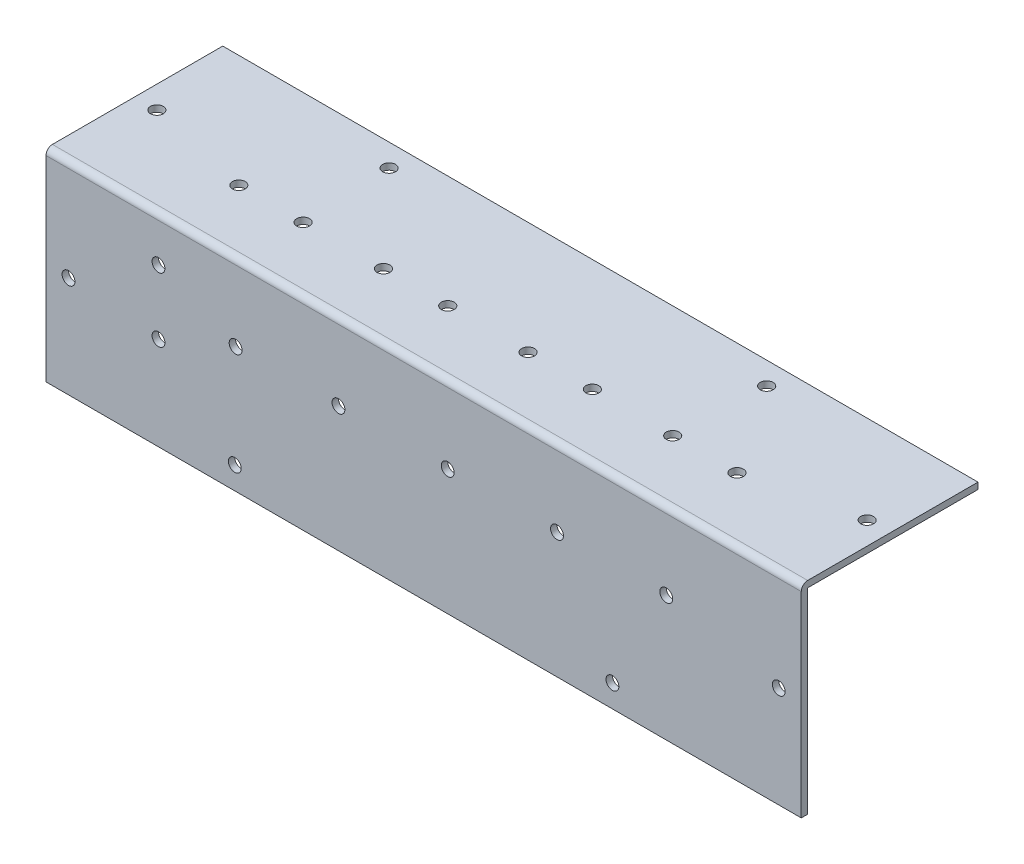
ISO-10303-21;
HEADER;
FILE_DESCRIPTION(('STEP AP214'),'2;1');
FILE_NAME('part.step','',(''),(''),'','','');
FILE_SCHEMA(('AUTOMOTIVE_DESIGN { 1 0 10303 214 1 1 1 1 }'));
ENDSEC;
DATA;
#1=APPLICATION_CONTEXT('core data for automotive mechanical design processes');
#2=APPLICATION_PROTOCOL_DEFINITION('international standard','automotive_design',2000,#1);
#3=PRODUCT_CONTEXT('',#1,'mechanical');
#4=PRODUCT('Part','Part','',(#3));
#5=PRODUCT_RELATED_PRODUCT_CATEGORY('part','',(#4));
#6=PRODUCT_DEFINITION_FORMATION('','',#4);
#7=PRODUCT_DEFINITION_CONTEXT('part definition',#1,'design');
#8=PRODUCT_DEFINITION('design','',#6,#7);
#9=PRODUCT_DEFINITION_SHAPE('','',#8);
#10=(LENGTH_UNIT() NAMED_UNIT(*) SI_UNIT(.MILLI.,.METRE.));
#11=(NAMED_UNIT(*) PLANE_ANGLE_UNIT() SI_UNIT($,.RADIAN.));
#12=(NAMED_UNIT(*) SI_UNIT($,.STERADIAN.) SOLID_ANGLE_UNIT());
#13=UNCERTAINTY_MEASURE_WITH_UNIT(LENGTH_MEASURE(1.E-05),#10,'distance_accuracy_value','');
#14=(GEOMETRIC_REPRESENTATION_CONTEXT(3) GLOBAL_UNCERTAINTY_ASSIGNED_CONTEXT((#13)) GLOBAL_UNIT_ASSIGNED_CONTEXT((#10,
#11,#12)) REPRESENTATION_CONTEXT('',''));
#15=CARTESIAN_POINT('',(0.,0.,0.));
#16=DIRECTION('',(0.,0.,1.));
#17=DIRECTION('',(1.,0.,0.));
#18=AXIS2_PLACEMENT_3D('',#15,#16,#17);
#19=CARTESIAN_POINT('',(0.,0.,2.));
#20=DIRECTION('',(1.,0.,0.));
#21=DIRECTION('',(0.,0.,-1.));
#22=AXIS2_PLACEMENT_3D('',#19,#20,#21);
#23=PLANE('',#22);
#24=DIRECTION('',(0.,-1.,0.));
#25=VECTOR('',#24,1.);
#26=CARTESIAN_POINT('',(0.,0.,2.));
#27=LINE('',#26,#25);
#28=CARTESIAN_POINT('',(0.,61.,2.));
#29=VERTEX_POINT('',#28);
#30=CARTESIAN_POINT('',(0.,0.,2.));
#31=VERTEX_POINT('',#30);
#32=EDGE_CURVE('E132',#29,#31,#27,.T.);
#33=ORIENTED_EDGE('',*,*,#32,.F.);
#34=CARTESIAN_POINT('',(0.,61.,0.));
#35=DIRECTION('',(1.,0.,0.));
#36=DIRECTION('',(0.,0.,-1.));
#37=AXIS2_PLACEMENT_3D('',#34,#35,#36);
#38=CIRCLE('',#37,2.);
#39=CARTESIAN_POINT('',(0.,63.,0.));
#40=VERTEX_POINT('',#39);
#41=EDGE_CURVE('E55',#29,#40,#38,.F.);
#42=ORIENTED_EDGE('',*,*,#41,.T.);
#43=DIRECTION('',(0.,0.,1.));
#44=VECTOR('',#43,1.);
#45=CARTESIAN_POINT('',(0.,63.,-53.));
#46=LINE('',#45,#44);
#47=CARTESIAN_POINT('',(0.,63.,-53.));
#48=VERTEX_POINT('',#47);
#49=EDGE_CURVE('E113',#48,#40,#46,.T.);
#50=ORIENTED_EDGE('',*,*,#49,.F.);
#51=DIRECTION('',(0.,-1.,0.));
#52=VECTOR('',#51,1.);
#53=CARTESIAN_POINT('',(0.,61.,-53.));
#54=LINE('',#53,#52);
#55=CARTESIAN_POINT('',(0.,61.,-53.));
#56=VERTEX_POINT('',#55);
#57=EDGE_CURVE('E108',#48,#56,#54,.T.);
#58=ORIENTED_EDGE('',*,*,#57,.T.);
#59=DIRECTION('',(0.,0.,1.));
#60=VECTOR('',#59,1.);
#61=CARTESIAN_POINT('',(0.,61.,-53.));
#62=LINE('',#61,#60);
#63=CARTESIAN_POINT('',(0.,61.,0.));
#64=VERTEX_POINT('',#63);
#65=EDGE_CURVE('E91',#56,#64,#62,.T.);
#66=ORIENTED_EDGE('',*,*,#65,.T.);
#67=DIRECTION('',(0.,-1.,0.));
#68=VECTOR('',#67,1.);
#69=CARTESIAN_POINT('',(0.,0.,0.));
#70=LINE('',#69,#68);
#71=CARTESIAN_POINT('',(0.,0.,0.));
#72=VERTEX_POINT('',#71);
#73=EDGE_CURVE('E124',#64,#72,#70,.T.);
#74=ORIENTED_EDGE('',*,*,#73,.T.);
#75=DIRECTION('',(0.,0.,-1.));
#76=VECTOR('',#75,1.);
#77=CARTESIAN_POINT('',(0.,0.,2.));
#78=LINE('',#77,#76);
#79=EDGE_CURVE('E206',#31,#72,#78,.T.);
#80=ORIENTED_EDGE('',*,*,#79,.F.);
#81=EDGE_LOOP('',(#33,#42,#50,#58,#66,#74,#80));
#82=FACE_BOUND('',#81,.T.);
#83=ADVANCED_FACE('F33',(#82),#23,.F.);
#84=CARTESIAN_POINT('',(0.,0.,2.));
#85=DIRECTION('',(0.,1.,0.));
#86=DIRECTION('',(0.,0.,1.));
#87=AXIS2_PLACEMENT_3D('',#84,#85,#86);
#88=PLANE('',#87);
#89=DIRECTION('',(1.,0.,0.));
#90=VECTOR('',#89,1.);
#91=CARTESIAN_POINT('',(0.,0.,0.));
#92=LINE('',#91,#90);
#93=CARTESIAN_POINT('',(235.,0.,0.));
#94=VERTEX_POINT('',#93);
#95=EDGE_CURVE('E140',#72,#94,#92,.T.);
#96=ORIENTED_EDGE('',*,*,#95,.T.);
#97=DIRECTION('',(0.,0.,-1.));
#98=VECTOR('',#97,1.);
#99=CARTESIAN_POINT('',(235.,0.,2.));
#100=LINE('',#99,#98);
#101=CARTESIAN_POINT('',(235.,0.,2.));
#102=VERTEX_POINT('',#101);
#103=EDGE_CURVE('E139',#102,#94,#100,.T.);
#104=ORIENTED_EDGE('',*,*,#103,.F.);
#105=DIRECTION('',(1.,0.,0.));
#106=VECTOR('',#105,1.);
#107=CARTESIAN_POINT('',(0.,0.,2.));
#108=LINE('',#107,#106);
#109=EDGE_CURVE('E134',#31,#102,#108,.T.);
#110=ORIENTED_EDGE('',*,*,#109,.F.);
#111=ORIENTED_EDGE('',*,*,#79,.T.);
#112=EDGE_LOOP('',(#96,#104,#110,#111));
#113=FACE_BOUND('',#112,.T.);
#114=ADVANCED_FACE('F218',(#113),#88,.F.);
#115=CARTESIAN_POINT('',(235.,0.,2.));
#116=DIRECTION('',(-1.,0.,0.));
#117=DIRECTION('',(0.,0.,1.));
#118=AXIS2_PLACEMENT_3D('',#115,#116,#117);
#119=PLANE('',#118);
#120=DIRECTION('',(0.,0.,1.));
#121=VECTOR('',#120,1.);
#122=CARTESIAN_POINT('',(235.,63.,-53.));
#123=LINE('',#122,#121);
#124=CARTESIAN_POINT('',(235.,63.,-53.));
#125=VERTEX_POINT('',#124);
#126=CARTESIAN_POINT('',(235.,63.,0.));
#127=VERTEX_POINT('',#126);
#128=EDGE_CURVE('E125',#125,#127,#123,.T.);
#129=ORIENTED_EDGE('',*,*,#128,.T.);
#130=CARTESIAN_POINT('',(235.,61.,0.));
#131=DIRECTION('',(-1.,0.,0.));
#132=DIRECTION('',(0.,0.,1.));
#133=AXIS2_PLACEMENT_3D('',#130,#131,#132);
#134=CIRCLE('',#133,2.);
#135=CARTESIAN_POINT('',(235.,61.,2.));
#136=VERTEX_POINT('',#135);
#137=EDGE_CURVE('E11',#127,#136,#134,.F.);
#138=ORIENTED_EDGE('',*,*,#137,.T.);
#139=DIRECTION('',(0.,1.,0.));
#140=VECTOR('',#139,1.);
#141=CARTESIAN_POINT('',(235.,0.,2.));
#142=LINE('',#141,#140);
#143=EDGE_CURVE('E136',#102,#136,#142,.T.);
#144=ORIENTED_EDGE('',*,*,#143,.F.);
#145=ORIENTED_EDGE('',*,*,#103,.T.);
#146=DIRECTION('',(0.,1.,0.));
#147=VECTOR('',#146,1.);
#148=CARTESIAN_POINT('',(235.,0.,0.));
#149=LINE('',#148,#147);
#150=CARTESIAN_POINT('',(235.,61.,0.));
#151=VERTEX_POINT('',#150);
#152=EDGE_CURVE('E142',#94,#151,#149,.T.);
#153=ORIENTED_EDGE('',*,*,#152,.T.);
#154=DIRECTION('',(0.,0.,1.));
#155=VECTOR('',#154,1.);
#156=CARTESIAN_POINT('',(235.,61.,-53.));
#157=LINE('',#156,#155);
#158=CARTESIAN_POINT('',(235.,61.,-53.));
#159=VERTEX_POINT('',#158);
#160=EDGE_CURVE('E100',#159,#151,#157,.T.);
#161=ORIENTED_EDGE('',*,*,#160,.F.);
#162=DIRECTION('',(0.,1.,0.));
#163=VECTOR('',#162,1.);
#164=CARTESIAN_POINT('',(235.,61.,-53.));
#165=LINE('',#164,#163);
#166=EDGE_CURVE('E111',#159,#125,#165,.T.);
#167=ORIENTED_EDGE('',*,*,#166,.T.);
#168=EDGE_LOOP('',(#129,#138,#144,#145,#153,#161,#167));
#169=FACE_BOUND('',#168,.T.);
#170=ADVANCED_FACE('F221',(#169),#119,.F.);
#171=CARTESIAN_POINT('',(0.,0.,2.));
#172=DIRECTION('',(0.,0.,-1.));
#173=DIRECTION('',(-1.,0.,0.));
#174=AXIS2_PLACEMENT_3D('',#171,#172,#173);
#175=PLANE('',#174);
#176=CARTESIAN_POINT('',(35.,29.,2.));
#177=DIRECTION('',(0.,0.,1.));
#178=DIRECTION('',(1.,0.,0.));
#179=AXIS2_PLACEMENT_3D('',#176,#177,#178);
#180=CIRCLE('',#179,2.);
#181=CARTESIAN_POINT('',(37.,29.,2.));
#182=VERTEX_POINT('',#181);
#183=EDGE_CURVE('E372',#182,#182,#180,.T.);
#184=ORIENTED_EDGE('',*,*,#183,.F.);
#185=EDGE_LOOP('',(#184));
#186=FACE_BOUND('',#185,.T.);
#187=CARTESIAN_POINT('',(35.,49.,2.));
#188=DIRECTION('',(0.,0.,1.));
#189=DIRECTION('',(1.,0.,0.));
#190=AXIS2_PLACEMENT_3D('',#187,#188,#189);
#191=CIRCLE('',#190,2.);
#192=CARTESIAN_POINT('',(37.,49.,2.));
#193=VERTEX_POINT('',#192);
#194=EDGE_CURVE('E378',#193,#193,#191,.T.);
#195=ORIENTED_EDGE('',*,*,#194,.F.);
#196=EDGE_LOOP('',(#195));
#197=FACE_BOUND('',#196,.T.);
#198=CARTESIAN_POINT('',(193.,39.,2.));
#199=DIRECTION('',(0.,0.,1.));
#200=DIRECTION('',(1.,0.,0.));
#201=AXIS2_PLACEMENT_3D('',#198,#199,#200);
#202=CIRCLE('',#201,2.);
#203=CARTESIAN_POINT('',(195.,39.,2.));
#204=VERTEX_POINT('',#203);
#205=EDGE_CURVE('E384',#204,#204,#202,.T.);
#206=ORIENTED_EDGE('',*,*,#205,.F.);
#207=EDGE_LOOP('',(#206));
#208=FACE_BOUND('',#207,.T.);
#209=CARTESIAN_POINT('',(159.,39.,2.));
#210=DIRECTION('',(0.,0.,1.));
#211=DIRECTION('',(1.,0.,0.));
#212=AXIS2_PLACEMENT_3D('',#209,#210,#211);
#213=CIRCLE('',#212,2.);
#214=CARTESIAN_POINT('',(161.,39.,2.));
#215=VERTEX_POINT('',#214);
#216=EDGE_CURVE('E390',#215,#215,#213,.T.);
#217=ORIENTED_EDGE('',*,*,#216,.F.);
#218=EDGE_LOOP('',(#217));
#219=FACE_BOUND('',#218,.T.);
#220=CARTESIAN_POINT('',(125.,39.,2.));
#221=DIRECTION('',(0.,0.,1.));
#222=DIRECTION('',(1.,0.,0.));
#223=AXIS2_PLACEMENT_3D('',#220,#221,#222);
#224=CIRCLE('',#223,2.);
#225=CARTESIAN_POINT('',(127.,39.,2.));
#226=VERTEX_POINT('',#225);
#227=EDGE_CURVE('E396',#226,#226,#224,.T.);
#228=ORIENTED_EDGE('',*,*,#227,.F.);
#229=EDGE_LOOP('',(#228));
#230=FACE_BOUND('',#229,.T.);
#231=CARTESIAN_POINT('',(91.,39.,2.));
#232=DIRECTION('',(0.,0.,1.));
#233=DIRECTION('',(1.,0.,0.));
#234=AXIS2_PLACEMENT_3D('',#231,#232,#233);
#235=CIRCLE('',#234,2.);
#236=CARTESIAN_POINT('',(93.,39.,2.));
#237=VERTEX_POINT('',#236);
#238=EDGE_CURVE('E402',#237,#237,#235,.T.);
#239=ORIENTED_EDGE('',*,*,#238,.F.);
#240=EDGE_LOOP('',(#239));
#241=FACE_BOUND('',#240,.T.);
#242=CARTESIAN_POINT('',(59.,39.,2.));
#243=DIRECTION('',(0.,0.,1.));
#244=DIRECTION('',(1.,0.,0.));
#245=AXIS2_PLACEMENT_3D('',#242,#243,#244);
#246=CIRCLE('',#245,2.);
#247=CARTESIAN_POINT('',(61.,39.,2.));
#248=VERTEX_POINT('',#247);
#249=EDGE_CURVE('E408',#248,#248,#246,.T.);
#250=ORIENTED_EDGE('',*,*,#249,.F.);
#251=EDGE_LOOP('',(#250));
#252=FACE_BOUND('',#251,.T.);
#253=CARTESIAN_POINT('',(58.75,6.99999999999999,2.));
#254=DIRECTION('',(0.,0.,1.));
#255=DIRECTION('',(1.,0.,0.));
#256=AXIS2_PLACEMENT_3D('',#253,#254,#255);
#257=CIRCLE('',#256,2.);
#258=CARTESIAN_POINT('',(60.75,6.99999999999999,2.));
#259=VERTEX_POINT('',#258);
#260=EDGE_CURVE('E414',#259,#259,#257,.T.);
#261=ORIENTED_EDGE('',*,*,#260,.F.);
#262=EDGE_LOOP('',(#261));
#263=FACE_BOUND('',#262,.T.);
#264=CARTESIAN_POINT('',(176.25,7.,2.));
#265=DIRECTION('',(0.,0.,1.));
#266=DIRECTION('',(1.,0.,0.));
#267=AXIS2_PLACEMENT_3D('',#264,#265,#266);
#268=CIRCLE('',#267,2.);
#269=CARTESIAN_POINT('',(178.25,7.,2.));
#270=VERTEX_POINT('',#269);
#271=EDGE_CURVE('E420',#270,#270,#268,.T.);
#272=ORIENTED_EDGE('',*,*,#271,.F.);
#273=EDGE_LOOP('',(#272));
#274=FACE_BOUND('',#273,.T.);
#275=CARTESIAN_POINT('',(228.,31.5,2.));
#276=DIRECTION('',(0.,0.,1.));
#277=DIRECTION('',(1.,0.,0.));
#278=AXIS2_PLACEMENT_3D('',#275,#276,#277);
#279=CIRCLE('',#278,2.);
#280=CARTESIAN_POINT('',(230.,31.5,2.));
#281=VERTEX_POINT('',#280);
#282=EDGE_CURVE('E426',#281,#281,#279,.T.);
#283=ORIENTED_EDGE('',*,*,#282,.F.);
#284=EDGE_LOOP('',(#283));
#285=FACE_BOUND('',#284,.T.);
#286=CARTESIAN_POINT('',(7.,31.5,2.));
#287=DIRECTION('',(0.,0.,1.));
#288=DIRECTION('',(1.,0.,0.));
#289=AXIS2_PLACEMENT_3D('',#286,#287,#288);
#290=CIRCLE('',#289,2.);
#291=CARTESIAN_POINT('',(9.00000000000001,31.5,2.));
#292=VERTEX_POINT('',#291);
#293=EDGE_CURVE('E114',#292,#292,#290,.T.);
#294=ORIENTED_EDGE('',*,*,#293,.F.);
#295=EDGE_LOOP('',(#294));
#296=FACE_BOUND('',#295,.T.);
#297=ORIENTED_EDGE('',*,*,#143,.T.);
#298=DIRECTION('',(-1.,0.,0.));
#299=VECTOR('',#298,1.);
#300=CARTESIAN_POINT('',(0.,61.,2.));
#301=LINE('',#300,#299);
#302=EDGE_CURVE('E203',#136,#29,#301,.T.);
#303=ORIENTED_EDGE('',*,*,#302,.T.);
#304=ORIENTED_EDGE('',*,*,#32,.T.);
#305=ORIENTED_EDGE('',*,*,#109,.T.);
#306=EDGE_LOOP('',(#297,#303,#304,#305));
#307=FACE_BOUND('',#306,.T.);
#308=ADVANCED_FACE('F223',(#186,#197,#208,#219,#230,#241,#252,#263,#274,#285,#296,#307),#175,.F.);
#309=CARTESIAN_POINT('',(0.,0.,0.));
#310=DIRECTION('',(0.,0.,-1.));
#311=DIRECTION('',(-1.,0.,0.));
#312=AXIS2_PLACEMENT_3D('',#309,#310,#311);
#313=PLANE('',#312);
#314=CARTESIAN_POINT('',(35.,29.,0.));
#315=DIRECTION('',(0.,0.,-1.));
#316=DIRECTION('',(-1.,0.,0.));
#317=AXIS2_PLACEMENT_3D('',#314,#315,#316);
#318=CIRCLE('',#317,2.);
#319=CARTESIAN_POINT('',(33.,29.,0.));
#320=VERTEX_POINT('',#319);
#321=EDGE_CURVE('E157',#320,#320,#318,.F.);
#322=ORIENTED_EDGE('',*,*,#321,.T.);
#323=EDGE_LOOP('',(#322));
#324=FACE_BOUND('',#323,.T.);
#325=CARTESIAN_POINT('',(35.,49.,0.));
#326=DIRECTION('',(0.,0.,-1.));
#327=DIRECTION('',(-1.,0.,0.));
#328=AXIS2_PLACEMENT_3D('',#325,#326,#327);
#329=CIRCLE('',#328,2.);
#330=CARTESIAN_POINT('',(33.,49.,0.));
#331=VERTEX_POINT('',#330);
#332=EDGE_CURVE('E375',#331,#331,#329,.F.);
#333=ORIENTED_EDGE('',*,*,#332,.T.);
#334=EDGE_LOOP('',(#333));
#335=FACE_BOUND('',#334,.T.);
#336=CARTESIAN_POINT('',(193.,39.,0.));
#337=DIRECTION('',(0.,0.,-1.));
#338=DIRECTION('',(-1.,0.,0.));
#339=AXIS2_PLACEMENT_3D('',#336,#337,#338);
#340=CIRCLE('',#339,2.);
#341=CARTESIAN_POINT('',(191.,39.,0.));
#342=VERTEX_POINT('',#341);
#343=EDGE_CURVE('E381',#342,#342,#340,.F.);
#344=ORIENTED_EDGE('',*,*,#343,.T.);
#345=EDGE_LOOP('',(#344));
#346=FACE_BOUND('',#345,.T.);
#347=CARTESIAN_POINT('',(159.,39.,0.));
#348=DIRECTION('',(0.,0.,-1.));
#349=DIRECTION('',(-1.,0.,0.));
#350=AXIS2_PLACEMENT_3D('',#347,#348,#349);
#351=CIRCLE('',#350,2.);
#352=CARTESIAN_POINT('',(157.,39.,0.));
#353=VERTEX_POINT('',#352);
#354=EDGE_CURVE('E387',#353,#353,#351,.F.);
#355=ORIENTED_EDGE('',*,*,#354,.T.);
#356=EDGE_LOOP('',(#355));
#357=FACE_BOUND('',#356,.T.);
#358=CARTESIAN_POINT('',(125.,39.,0.));
#359=DIRECTION('',(0.,0.,-1.));
#360=DIRECTION('',(-1.,0.,0.));
#361=AXIS2_PLACEMENT_3D('',#358,#359,#360);
#362=CIRCLE('',#361,2.);
#363=CARTESIAN_POINT('',(123.,39.,0.));
#364=VERTEX_POINT('',#363);
#365=EDGE_CURVE('E393',#364,#364,#362,.F.);
#366=ORIENTED_EDGE('',*,*,#365,.T.);
#367=EDGE_LOOP('',(#366));
#368=FACE_BOUND('',#367,.T.);
#369=CARTESIAN_POINT('',(91.,39.,0.));
#370=DIRECTION('',(0.,0.,-1.));
#371=DIRECTION('',(-1.,0.,0.));
#372=AXIS2_PLACEMENT_3D('',#369,#370,#371);
#373=CIRCLE('',#372,2.);
#374=CARTESIAN_POINT('',(89.,39.,0.));
#375=VERTEX_POINT('',#374);
#376=EDGE_CURVE('E399',#375,#375,#373,.F.);
#377=ORIENTED_EDGE('',*,*,#376,.T.);
#378=EDGE_LOOP('',(#377));
#379=FACE_BOUND('',#378,.T.);
#380=CARTESIAN_POINT('',(59.,39.,0.));
#381=DIRECTION('',(0.,0.,-1.));
#382=DIRECTION('',(-1.,0.,0.));
#383=AXIS2_PLACEMENT_3D('',#380,#381,#382);
#384=CIRCLE('',#383,2.);
#385=CARTESIAN_POINT('',(57.,39.,0.));
#386=VERTEX_POINT('',#385);
#387=EDGE_CURVE('E405',#386,#386,#384,.F.);
#388=ORIENTED_EDGE('',*,*,#387,.T.);
#389=EDGE_LOOP('',(#388));
#390=FACE_BOUND('',#389,.T.);
#391=CARTESIAN_POINT('',(58.75,6.99999999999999,0.));
#392=DIRECTION('',(0.,0.,-1.));
#393=DIRECTION('',(-1.,0.,0.));
#394=AXIS2_PLACEMENT_3D('',#391,#392,#393);
#395=CIRCLE('',#394,2.);
#396=CARTESIAN_POINT('',(56.75,6.99999999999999,0.));
#397=VERTEX_POINT('',#396);
#398=EDGE_CURVE('E411',#397,#397,#395,.F.);
#399=ORIENTED_EDGE('',*,*,#398,.T.);
#400=EDGE_LOOP('',(#399));
#401=FACE_BOUND('',#400,.T.);
#402=CARTESIAN_POINT('',(176.25,7.,0.));
#403=DIRECTION('',(0.,0.,-1.));
#404=DIRECTION('',(-1.,0.,0.));
#405=AXIS2_PLACEMENT_3D('',#402,#403,#404);
#406=CIRCLE('',#405,2.);
#407=CARTESIAN_POINT('',(174.25,7.,0.));
#408=VERTEX_POINT('',#407);
#409=EDGE_CURVE('E417',#408,#408,#406,.F.);
#410=ORIENTED_EDGE('',*,*,#409,.T.);
#411=EDGE_LOOP('',(#410));
#412=FACE_BOUND('',#411,.T.);
#413=CARTESIAN_POINT('',(228.,31.5,0.));
#414=DIRECTION('',(0.,0.,-1.));
#415=DIRECTION('',(-1.,0.,0.));
#416=AXIS2_PLACEMENT_3D('',#413,#414,#415);
#417=CIRCLE('',#416,2.);
#418=CARTESIAN_POINT('',(226.,31.5,0.));
#419=VERTEX_POINT('',#418);
#420=EDGE_CURVE('E423',#419,#419,#417,.F.);
#421=ORIENTED_EDGE('',*,*,#420,.T.);
#422=EDGE_LOOP('',(#421));
#423=FACE_BOUND('',#422,.T.);
#424=CARTESIAN_POINT('',(7.,31.5,0.));
#425=DIRECTION('',(0.,0.,-1.));
#426=DIRECTION('',(-1.,0.,0.));
#427=AXIS2_PLACEMENT_3D('',#424,#425,#426);
#428=CIRCLE('',#427,2.);
#429=CARTESIAN_POINT('',(5.,31.5,0.));
#430=VERTEX_POINT('',#429);
#431=EDGE_CURVE('E117',#430,#430,#428,.F.);
#432=ORIENTED_EDGE('',*,*,#431,.T.);
#433=EDGE_LOOP('',(#432));
#434=FACE_BOUND('',#433,.T.);
#435=ORIENTED_EDGE('',*,*,#73,.F.);
#436=DIRECTION('',(-1.,0.,0.));
#437=VECTOR('',#436,1.);
#438=CARTESIAN_POINT('',(0.,61.,0.));
#439=LINE('',#438,#437);
#440=EDGE_CURVE('E97',#151,#64,#439,.T.);
#441=ORIENTED_EDGE('',*,*,#440,.F.);
#442=ORIENTED_EDGE('',*,*,#152,.F.);
#443=ORIENTED_EDGE('',*,*,#95,.F.);
#444=EDGE_LOOP('',(#435,#441,#442,#443));
#445=FACE_BOUND('',#444,.T.);
#446=ADVANCED_FACE('F215',(#324,#335,#346,#357,#368,#379,#390,#401,#412,#423,#434,#445),#313,.T.);
#447=CARTESIAN_POINT('',(0.,63.,-53.));
#448=DIRECTION('',(0.,1.,0.));
#449=DIRECTION('',(0.,0.,1.));
#450=AXIS2_PLACEMENT_3D('',#447,#448,#449);
#451=PLANE('',#450);
#452=CARTESIAN_POINT('',(7.,63.,-25.5));
#453=DIRECTION('',(0.,1.,0.));
#454=DIRECTION('',(0.,0.,1.));
#455=AXIS2_PLACEMENT_3D('',#452,#453,#454);
#456=CIRCLE('',#455,2.);
#457=CARTESIAN_POINT('',(7.,63.,-23.5));
#458=VERTEX_POINT('',#457);
#459=EDGE_CURVE('E202',#458,#458,#456,.T.);
#460=ORIENTED_EDGE('',*,*,#459,.F.);
#461=EDGE_LOOP('',(#460));
#462=FACE_BOUND('',#461,.T.);
#463=CARTESIAN_POINT('',(58.75,63.,-46.));
#464=DIRECTION('',(0.,1.,0.));
#465=DIRECTION('',(0.,0.,1.));
#466=AXIS2_PLACEMENT_3D('',#463,#464,#465);
#467=CIRCLE('',#466,2.);
#468=CARTESIAN_POINT('',(58.75,63.,-44.));
#469=VERTEX_POINT('',#468);
#470=EDGE_CURVE('E198',#469,#469,#467,.T.);
#471=ORIENTED_EDGE('',*,*,#470,.F.);
#472=EDGE_LOOP('',(#471));
#473=FACE_BOUND('',#472,.T.);
#474=CARTESIAN_POINT('',(176.25,63.,-46.));
#475=DIRECTION('',(0.,1.,0.));
#476=DIRECTION('',(0.,0.,1.));
#477=AXIS2_PLACEMENT_3D('',#474,#475,#476);
#478=CIRCLE('',#477,2.);
#479=CARTESIAN_POINT('',(176.25,63.,-44.));
#480=VERTEX_POINT('',#479);
#481=EDGE_CURVE('E194',#480,#480,#478,.T.);
#482=ORIENTED_EDGE('',*,*,#481,.F.);
#483=EDGE_LOOP('',(#482));
#484=FACE_BOUND('',#483,.T.);
#485=CARTESIAN_POINT('',(228.,63.,-25.5));
#486=DIRECTION('',(0.,1.,0.));
#487=DIRECTION('',(0.,0.,1.));
#488=AXIS2_PLACEMENT_3D('',#485,#486,#487);
#489=CIRCLE('',#488,2.);
#490=CARTESIAN_POINT('',(228.,63.,-23.5));
#491=VERTEX_POINT('',#490);
#492=EDGE_CURVE('E190',#491,#491,#489,.T.);
#493=ORIENTED_EDGE('',*,*,#492,.F.);
#494=EDGE_LOOP('',(#493));
#495=FACE_BOUND('',#494,.T.);
#496=CARTESIAN_POINT('',(195.,63.,-18.));
#497=DIRECTION('',(0.,1.,0.));
#498=DIRECTION('',(0.,0.,1.));
#499=AXIS2_PLACEMENT_3D('',#496,#497,#498);
#500=CIRCLE('',#499,2.);
#501=CARTESIAN_POINT('',(195.,63.,-16.));
#502=VERTEX_POINT('',#501);
#503=EDGE_CURVE('E186',#502,#502,#500,.T.);
#504=ORIENTED_EDGE('',*,*,#503,.F.);
#505=EDGE_LOOP('',(#504));
#506=FACE_BOUND('',#505,.T.);
#507=CARTESIAN_POINT('',(175.,63.,-18.));
#508=DIRECTION('',(0.,1.,0.));
#509=DIRECTION('',(0.,0.,1.));
#510=AXIS2_PLACEMENT_3D('',#507,#508,#509);
#511=CIRCLE('',#510,2.);
#512=CARTESIAN_POINT('',(175.,63.,-16.));
#513=VERTEX_POINT('',#512);
#514=EDGE_CURVE('E182',#513,#513,#511,.T.);
#515=ORIENTED_EDGE('',*,*,#514,.F.);
#516=EDGE_LOOP('',(#515));
#517=FACE_BOUND('',#516,.T.);
#518=CARTESIAN_POINT('',(150.,63.,-18.));
#519=DIRECTION('',(0.,1.,0.));
#520=DIRECTION('',(0.,0.,1.));
#521=AXIS2_PLACEMENT_3D('',#518,#519,#520);
#522=CIRCLE('',#521,2.);
#523=CARTESIAN_POINT('',(150.,63.,-16.));
#524=VERTEX_POINT('',#523);
#525=EDGE_CURVE('E178',#524,#524,#522,.T.);
#526=ORIENTED_EDGE('',*,*,#525,.F.);
#527=EDGE_LOOP('',(#526));
#528=FACE_BOUND('',#527,.T.);
#529=CARTESIAN_POINT('',(130.,63.,-18.));
#530=DIRECTION('',(0.,1.,0.));
#531=DIRECTION('',(0.,0.,1.));
#532=AXIS2_PLACEMENT_3D('',#529,#530,#531);
#533=CIRCLE('',#532,2.);
#534=CARTESIAN_POINT('',(130.,63.,-16.));
#535=VERTEX_POINT('',#534);
#536=EDGE_CURVE('E174',#535,#535,#533,.T.);
#537=ORIENTED_EDGE('',*,*,#536,.F.);
#538=EDGE_LOOP('',(#537));
#539=FACE_BOUND('',#538,.T.);
#540=CARTESIAN_POINT('',(105.,63.,-18.));
#541=DIRECTION('',(0.,1.,0.));
#542=DIRECTION('',(0.,0.,1.));
#543=AXIS2_PLACEMENT_3D('',#540,#541,#542);
#544=CIRCLE('',#543,2.);
#545=CARTESIAN_POINT('',(105.,63.,-16.));
#546=VERTEX_POINT('',#545);
#547=EDGE_CURVE('E170',#546,#546,#544,.T.);
#548=ORIENTED_EDGE('',*,*,#547,.F.);
#549=EDGE_LOOP('',(#548));
#550=FACE_BOUND('',#549,.T.);
#551=CARTESIAN_POINT('',(85.,63.,-18.));
#552=DIRECTION('',(0.,1.,0.));
#553=DIRECTION('',(0.,0.,1.));
#554=AXIS2_PLACEMENT_3D('',#551,#552,#553);
#555=CIRCLE('',#554,2.);
#556=CARTESIAN_POINT('',(85.,63.,-16.));
#557=VERTEX_POINT('',#556);
#558=EDGE_CURVE('E166',#557,#557,#555,.T.);
#559=ORIENTED_EDGE('',*,*,#558,.F.);
#560=EDGE_LOOP('',(#559));
#561=FACE_BOUND('',#560,.T.);
#562=CARTESIAN_POINT('',(60.,63.,-18.));
#563=DIRECTION('',(0.,1.,0.));
#564=DIRECTION('',(0.,0.,1.));
#565=AXIS2_PLACEMENT_3D('',#562,#563,#564);
#566=CIRCLE('',#565,2.);
#567=CARTESIAN_POINT('',(60.,63.,-16.));
#568=VERTEX_POINT('',#567);
#569=EDGE_CURVE('E162',#568,#568,#566,.T.);
#570=ORIENTED_EDGE('',*,*,#569,.F.);
#571=EDGE_LOOP('',(#570));
#572=FACE_BOUND('',#571,.T.);
#573=CARTESIAN_POINT('',(40.,63.,-18.));
#574=DIRECTION('',(0.,1.,0.));
#575=DIRECTION('',(0.,0.,1.));
#576=AXIS2_PLACEMENT_3D('',#573,#574,#575);
#577=CIRCLE('',#576,2.);
#578=CARTESIAN_POINT('',(40.,63.,-16.));
#579=VERTEX_POINT('',#578);
#580=EDGE_CURVE('E158',#579,#579,#577,.T.);
#581=ORIENTED_EDGE('',*,*,#580,.F.);
#582=EDGE_LOOP('',(#581));
#583=FACE_BOUND('',#582,.T.);
#584=ORIENTED_EDGE('',*,*,#49,.T.);
#585=DIRECTION('',(-1.,0.,0.));
#586=VECTOR('',#585,1.);
#587=CARTESIAN_POINT('',(235.,63.,0.));
#588=LINE('',#587,#586);
#589=EDGE_CURVE('E41',#40,#127,#588,.F.);
#590=ORIENTED_EDGE('',*,*,#589,.T.);
#591=ORIENTED_EDGE('',*,*,#128,.F.);
#592=DIRECTION('',(-1.,0.,0.));
#593=VECTOR('',#592,1.);
#594=CARTESIAN_POINT('',(0.,63.,-53.));
#595=LINE('',#594,#593);
#596=EDGE_CURVE('E101',#125,#48,#595,.T.);
#597=ORIENTED_EDGE('',*,*,#596,.T.);
#598=EDGE_LOOP('',(#584,#590,#591,#597));
#599=FACE_BOUND('',#598,.T.);
#600=ADVANCED_FACE('F243',(#462,#473,#484,#495,#506,#517,#528,#539,#550,#561,#572,#583,#599),
#451,.T.);
#601=CARTESIAN_POINT('',(0.,61.,-53.));
#602=DIRECTION('',(0.,-1.,0.));
#603=DIRECTION('',(0.,0.,-1.));
#604=AXIS2_PLACEMENT_3D('',#601,#602,#603);
#605=PLANE('',#604);
#606=CARTESIAN_POINT('',(7.,61.,-25.5));
#607=DIRECTION('',(0.,-1.,0.));
#608=DIRECTION('',(0.,0.,-1.));
#609=AXIS2_PLACEMENT_3D('',#606,#607,#608);
#610=CIRCLE('',#609,2.);
#611=CARTESIAN_POINT('',(7.,61.,-27.5));
#612=VERTEX_POINT('',#611);
#613=EDGE_CURVE('E199',#612,#612,#610,.T.);
#614=ORIENTED_EDGE('',*,*,#613,.F.);
#615=EDGE_LOOP('',(#614));
#616=FACE_BOUND('',#615,.T.);
#617=CARTESIAN_POINT('',(58.75,61.,-46.));
#618=DIRECTION('',(0.,-1.,0.));
#619=DIRECTION('',(0.,0.,-1.));
#620=AXIS2_PLACEMENT_3D('',#617,#618,#619);
#621=CIRCLE('',#620,2.);
#622=CARTESIAN_POINT('',(58.75,61.,-48.));
#623=VERTEX_POINT('',#622);
#624=EDGE_CURVE('E195',#623,#623,#621,.T.);
#625=ORIENTED_EDGE('',*,*,#624,.F.);
#626=EDGE_LOOP('',(#625));
#627=FACE_BOUND('',#626,.T.);
#628=CARTESIAN_POINT('',(176.25,61.,-46.));
#629=DIRECTION('',(0.,-1.,0.));
#630=DIRECTION('',(0.,0.,-1.));
#631=AXIS2_PLACEMENT_3D('',#628,#629,#630);
#632=CIRCLE('',#631,2.);
#633=CARTESIAN_POINT('',(176.25,61.,-48.));
#634=VERTEX_POINT('',#633);
#635=EDGE_CURVE('E191',#634,#634,#632,.T.);
#636=ORIENTED_EDGE('',*,*,#635,.F.);
#637=EDGE_LOOP('',(#636));
#638=FACE_BOUND('',#637,.T.);
#639=CARTESIAN_POINT('',(228.,61.,-25.5));
#640=DIRECTION('',(0.,-1.,0.));
#641=DIRECTION('',(0.,0.,-1.));
#642=AXIS2_PLACEMENT_3D('',#639,#640,#641);
#643=CIRCLE('',#642,2.);
#644=CARTESIAN_POINT('',(228.,61.,-27.5));
#645=VERTEX_POINT('',#644);
#646=EDGE_CURVE('E187',#645,#645,#643,.T.);
#647=ORIENTED_EDGE('',*,*,#646,.F.);
#648=EDGE_LOOP('',(#647));
#649=FACE_BOUND('',#648,.T.);
#650=CARTESIAN_POINT('',(195.,61.,-18.));
#651=DIRECTION('',(0.,-1.,0.));
#652=DIRECTION('',(0.,0.,-1.));
#653=AXIS2_PLACEMENT_3D('',#650,#651,#652);
#654=CIRCLE('',#653,2.);
#655=CARTESIAN_POINT('',(195.,61.,-20.));
#656=VERTEX_POINT('',#655);
#657=EDGE_CURVE('E183',#656,#656,#654,.T.);
#658=ORIENTED_EDGE('',*,*,#657,.F.);
#659=EDGE_LOOP('',(#658));
#660=FACE_BOUND('',#659,.T.);
#661=CARTESIAN_POINT('',(175.,61.,-18.));
#662=DIRECTION('',(0.,-1.,0.));
#663=DIRECTION('',(0.,0.,-1.));
#664=AXIS2_PLACEMENT_3D('',#661,#662,#663);
#665=CIRCLE('',#664,2.);
#666=CARTESIAN_POINT('',(175.,61.,-20.));
#667=VERTEX_POINT('',#666);
#668=EDGE_CURVE('E179',#667,#667,#665,.T.);
#669=ORIENTED_EDGE('',*,*,#668,.F.);
#670=EDGE_LOOP('',(#669));
#671=FACE_BOUND('',#670,.T.);
#672=CARTESIAN_POINT('',(150.,61.,-18.));
#673=DIRECTION('',(0.,-1.,0.));
#674=DIRECTION('',(0.,0.,-1.));
#675=AXIS2_PLACEMENT_3D('',#672,#673,#674);
#676=CIRCLE('',#675,2.);
#677=CARTESIAN_POINT('',(150.,61.,-20.));
#678=VERTEX_POINT('',#677);
#679=EDGE_CURVE('E175',#678,#678,#676,.T.);
#680=ORIENTED_EDGE('',*,*,#679,.F.);
#681=EDGE_LOOP('',(#680));
#682=FACE_BOUND('',#681,.T.);
#683=CARTESIAN_POINT('',(130.,61.,-18.));
#684=DIRECTION('',(0.,-1.,0.));
#685=DIRECTION('',(0.,0.,-1.));
#686=AXIS2_PLACEMENT_3D('',#683,#684,#685);
#687=CIRCLE('',#686,2.);
#688=CARTESIAN_POINT('',(130.,61.,-20.));
#689=VERTEX_POINT('',#688);
#690=EDGE_CURVE('E171',#689,#689,#687,.T.);
#691=ORIENTED_EDGE('',*,*,#690,.F.);
#692=EDGE_LOOP('',(#691));
#693=FACE_BOUND('',#692,.T.);
#694=CARTESIAN_POINT('',(105.,61.,-18.));
#695=DIRECTION('',(0.,-1.,0.));
#696=DIRECTION('',(0.,0.,-1.));
#697=AXIS2_PLACEMENT_3D('',#694,#695,#696);
#698=CIRCLE('',#697,2.);
#699=CARTESIAN_POINT('',(105.,61.,-20.));
#700=VERTEX_POINT('',#699);
#701=EDGE_CURVE('E167',#700,#700,#698,.T.);
#702=ORIENTED_EDGE('',*,*,#701,.F.);
#703=EDGE_LOOP('',(#702));
#704=FACE_BOUND('',#703,.T.);
#705=CARTESIAN_POINT('',(85.,61.,-18.));
#706=DIRECTION('',(0.,-1.,0.));
#707=DIRECTION('',(0.,0.,-1.));
#708=AXIS2_PLACEMENT_3D('',#705,#706,#707);
#709=CIRCLE('',#708,2.);
#710=CARTESIAN_POINT('',(85.,61.,-20.));
#711=VERTEX_POINT('',#710);
#712=EDGE_CURVE('E163',#711,#711,#709,.T.);
#713=ORIENTED_EDGE('',*,*,#712,.F.);
#714=EDGE_LOOP('',(#713));
#715=FACE_BOUND('',#714,.T.);
#716=CARTESIAN_POINT('',(60.,61.,-18.));
#717=DIRECTION('',(0.,-1.,0.));
#718=DIRECTION('',(0.,0.,-1.));
#719=AXIS2_PLACEMENT_3D('',#716,#717,#718);
#720=CIRCLE('',#719,2.);
#721=CARTESIAN_POINT('',(60.,61.,-20.));
#722=VERTEX_POINT('',#721);
#723=EDGE_CURVE('E159',#722,#722,#720,.T.);
#724=ORIENTED_EDGE('',*,*,#723,.F.);
#725=EDGE_LOOP('',(#724));
#726=FACE_BOUND('',#725,.T.);
#727=CARTESIAN_POINT('',(40.,61.,-18.));
#728=DIRECTION('',(0.,-1.,0.));
#729=DIRECTION('',(0.,0.,-1.));
#730=AXIS2_PLACEMENT_3D('',#727,#728,#729);
#731=CIRCLE('',#730,2.);
#732=CARTESIAN_POINT('',(40.,61.,-20.));
#733=VERTEX_POINT('',#732);
#734=EDGE_CURVE('E154',#733,#733,#731,.T.);
#735=ORIENTED_EDGE('',*,*,#734,.F.);
#736=EDGE_LOOP('',(#735));
#737=FACE_BOUND('',#736,.T.);
#738=ORIENTED_EDGE('',*,*,#160,.T.);
#739=ORIENTED_EDGE('',*,*,#440,.T.);
#740=ORIENTED_EDGE('',*,*,#65,.F.);
#741=DIRECTION('',(1.,0.,0.));
#742=VECTOR('',#741,1.);
#743=CARTESIAN_POINT('',(0.,61.,-53.));
#744=LINE('',#743,#742);
#745=EDGE_CURVE('E95',#56,#159,#744,.T.);
#746=ORIENTED_EDGE('',*,*,#745,.T.);
#747=EDGE_LOOP('',(#738,#739,#740,#746));
#748=FACE_BOUND('',#747,.T.);
#749=ADVANCED_FACE('F94',(#616,#627,#638,#649,#660,#671,#682,#693,#704,#715,#726,#737,#748),
#605,.T.);
#750=CARTESIAN_POINT('',(0.,0.,-53.));
#751=DIRECTION('',(0.,0.,-1.));
#752=DIRECTION('',(-1.,0.,0.));
#753=AXIS2_PLACEMENT_3D('',#750,#751,#752);
#754=PLANE('',#753);
#755=ORIENTED_EDGE('',*,*,#57,.F.);
#756=ORIENTED_EDGE('',*,*,#596,.F.);
#757=ORIENTED_EDGE('',*,*,#166,.F.);
#758=ORIENTED_EDGE('',*,*,#745,.F.);
#759=EDGE_LOOP('',(#755,#756,#757,#758));
#760=FACE_BOUND('',#759,.T.);
#761=ADVANCED_FACE('F106',(#760),#754,.T.);
#762=CARTESIAN_POINT('',(7.,31.5,-53.001025));
#763=DIRECTION('',(0.,0.,1.));
#764=DIRECTION('',(1.,0.,0.));
#765=AXIS2_PLACEMENT_3D('',#762,#763,#764);
#766=CYLINDRICAL_SURFACE('',#765,2.);
#767=ORIENTED_EDGE('',*,*,#431,.F.);
#768=EDGE_LOOP('',(#767));
#769=FACE_BOUND('',#768,.T.);
#770=ORIENTED_EDGE('',*,*,#293,.T.);
#771=EDGE_LOOP('',(#770));
#772=FACE_BOUND('',#771,.T.);
#773=ADVANCED_FACE('F256',(#769,#772),#766,.F.);
#774=CARTESIAN_POINT('',(228.,31.5,-53.001025));
#775=DIRECTION('',(0.,0.,1.));
#776=DIRECTION('',(1.,0.,0.));
#777=AXIS2_PLACEMENT_3D('',#774,#775,#776);
#778=CYLINDRICAL_SURFACE('',#777,2.);
#779=ORIENTED_EDGE('',*,*,#420,.F.);
#780=EDGE_LOOP('',(#779));
#781=FACE_BOUND('',#780,.T.);
#782=ORIENTED_EDGE('',*,*,#282,.T.);
#783=EDGE_LOOP('',(#782));
#784=FACE_BOUND('',#783,.T.);
#785=ADVANCED_FACE('F259',(#781,#784),#778,.F.);
#786=CARTESIAN_POINT('',(176.25,7.,-53.001025));
#787=DIRECTION('',(0.,0.,1.));
#788=DIRECTION('',(1.,0.,0.));
#789=AXIS2_PLACEMENT_3D('',#786,#787,#788);
#790=CYLINDRICAL_SURFACE('',#789,2.);
#791=ORIENTED_EDGE('',*,*,#409,.F.);
#792=EDGE_LOOP('',(#791));
#793=FACE_BOUND('',#792,.T.);
#794=ORIENTED_EDGE('',*,*,#271,.T.);
#795=EDGE_LOOP('',(#794));
#796=FACE_BOUND('',#795,.T.);
#797=ADVANCED_FACE('F263',(#793,#796),#790,.F.);
#798=CARTESIAN_POINT('',(58.75,6.99999999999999,-53.001025));
#799=DIRECTION('',(0.,0.,1.));
#800=DIRECTION('',(1.,0.,0.));
#801=AXIS2_PLACEMENT_3D('',#798,#799,#800);
#802=CYLINDRICAL_SURFACE('',#801,2.);
#803=ORIENTED_EDGE('',*,*,#398,.F.);
#804=EDGE_LOOP('',(#803));
#805=FACE_BOUND('',#804,.T.);
#806=ORIENTED_EDGE('',*,*,#260,.T.);
#807=EDGE_LOOP('',(#806));
#808=FACE_BOUND('',#807,.T.);
#809=ADVANCED_FACE('F267',(#805,#808),#802,.F.);
#810=CARTESIAN_POINT('',(59.,39.,-53.001025));
#811=DIRECTION('',(0.,0.,1.));
#812=DIRECTION('',(1.,0.,0.));
#813=AXIS2_PLACEMENT_3D('',#810,#811,#812);
#814=CYLINDRICAL_SURFACE('',#813,2.);
#815=ORIENTED_EDGE('',*,*,#387,.F.);
#816=EDGE_LOOP('',(#815));
#817=FACE_BOUND('',#816,.T.);
#818=ORIENTED_EDGE('',*,*,#249,.T.);
#819=EDGE_LOOP('',(#818));
#820=FACE_BOUND('',#819,.T.);
#821=ADVANCED_FACE('F271',(#817,#820),#814,.F.);
#822=CARTESIAN_POINT('',(91.,39.,-53.001025));
#823=DIRECTION('',(0.,0.,1.));
#824=DIRECTION('',(1.,0.,0.));
#825=AXIS2_PLACEMENT_3D('',#822,#823,#824);
#826=CYLINDRICAL_SURFACE('',#825,2.);
#827=ORIENTED_EDGE('',*,*,#376,.F.);
#828=EDGE_LOOP('',(#827));
#829=FACE_BOUND('',#828,.T.);
#830=ORIENTED_EDGE('',*,*,#238,.T.);
#831=EDGE_LOOP('',(#830));
#832=FACE_BOUND('',#831,.T.);
#833=ADVANCED_FACE('F275',(#829,#832),#826,.F.);
#834=CARTESIAN_POINT('',(125.,39.,-53.001025));
#835=DIRECTION('',(0.,0.,1.));
#836=DIRECTION('',(1.,0.,0.));
#837=AXIS2_PLACEMENT_3D('',#834,#835,#836);
#838=CYLINDRICAL_SURFACE('',#837,2.);
#839=ORIENTED_EDGE('',*,*,#365,.F.);
#840=EDGE_LOOP('',(#839));
#841=FACE_BOUND('',#840,.T.);
#842=ORIENTED_EDGE('',*,*,#227,.T.);
#843=EDGE_LOOP('',(#842));
#844=FACE_BOUND('',#843,.T.);
#845=ADVANCED_FACE('F279',(#841,#844),#838,.F.);
#846=CARTESIAN_POINT('',(159.,39.,-53.001025));
#847=DIRECTION('',(0.,0.,1.));
#848=DIRECTION('',(1.,0.,0.));
#849=AXIS2_PLACEMENT_3D('',#846,#847,#848);
#850=CYLINDRICAL_SURFACE('',#849,2.);
#851=ORIENTED_EDGE('',*,*,#354,.F.);
#852=EDGE_LOOP('',(#851));
#853=FACE_BOUND('',#852,.T.);
#854=ORIENTED_EDGE('',*,*,#216,.T.);
#855=EDGE_LOOP('',(#854));
#856=FACE_BOUND('',#855,.T.);
#857=ADVANCED_FACE('F283',(#853,#856),#850,.F.);
#858=CARTESIAN_POINT('',(193.,39.,-53.001025));
#859=DIRECTION('',(0.,0.,1.));
#860=DIRECTION('',(1.,0.,0.));
#861=AXIS2_PLACEMENT_3D('',#858,#859,#860);
#862=CYLINDRICAL_SURFACE('',#861,2.);
#863=ORIENTED_EDGE('',*,*,#343,.F.);
#864=EDGE_LOOP('',(#863));
#865=FACE_BOUND('',#864,.T.);
#866=ORIENTED_EDGE('',*,*,#205,.T.);
#867=EDGE_LOOP('',(#866));
#868=FACE_BOUND('',#867,.T.);
#869=ADVANCED_FACE('F287',(#865,#868),#862,.F.);
#870=CARTESIAN_POINT('',(35.,49.,-53.001025));
#871=DIRECTION('',(0.,0.,1.));
#872=DIRECTION('',(1.,0.,0.));
#873=AXIS2_PLACEMENT_3D('',#870,#871,#872);
#874=CYLINDRICAL_SURFACE('',#873,2.);
#875=ORIENTED_EDGE('',*,*,#332,.F.);
#876=EDGE_LOOP('',(#875));
#877=FACE_BOUND('',#876,.T.);
#878=ORIENTED_EDGE('',*,*,#194,.T.);
#879=EDGE_LOOP('',(#878));
#880=FACE_BOUND('',#879,.T.);
#881=ADVANCED_FACE('F291',(#877,#880),#874,.F.);
#882=CARTESIAN_POINT('',(35.,29.,-53.001025));
#883=DIRECTION('',(0.,0.,1.));
#884=DIRECTION('',(1.,0.,0.));
#885=AXIS2_PLACEMENT_3D('',#882,#883,#884);
#886=CYLINDRICAL_SURFACE('',#885,2.);
#887=ORIENTED_EDGE('',*,*,#321,.F.);
#888=EDGE_LOOP('',(#887));
#889=FACE_BOUND('',#888,.T.);
#890=ORIENTED_EDGE('',*,*,#183,.T.);
#891=EDGE_LOOP('',(#890));
#892=FACE_BOUND('',#891,.T.);
#893=ADVANCED_FACE('F295',(#889,#892),#886,.F.);
#894=CARTESIAN_POINT('',(40.,23.,-18.));
#895=DIRECTION('',(0.,1.,0.));
#896=DIRECTION('',(0.,0.,1.));
#897=AXIS2_PLACEMENT_3D('',#894,#895,#896);
#898=CYLINDRICAL_SURFACE('',#897,2.);
#899=ORIENTED_EDGE('',*,*,#734,.T.);
#900=EDGE_LOOP('',(#899));
#901=FACE_BOUND('',#900,.T.);
#902=ORIENTED_EDGE('',*,*,#580,.T.);
#903=EDGE_LOOP('',(#902));
#904=FACE_BOUND('',#903,.T.);
#905=ADVANCED_FACE('F299',(#901,#904),#898,.F.);
#906=CARTESIAN_POINT('',(60.,23.,-18.));
#907=DIRECTION('',(0.,1.,0.));
#908=DIRECTION('',(0.,0.,1.));
#909=AXIS2_PLACEMENT_3D('',#906,#907,#908);
#910=CYLINDRICAL_SURFACE('',#909,2.);
#911=ORIENTED_EDGE('',*,*,#723,.T.);
#912=EDGE_LOOP('',(#911));
#913=FACE_BOUND('',#912,.T.);
#914=ORIENTED_EDGE('',*,*,#569,.T.);
#915=EDGE_LOOP('',(#914));
#916=FACE_BOUND('',#915,.T.);
#917=ADVANCED_FACE('F303',(#913,#916),#910,.F.);
#918=CARTESIAN_POINT('',(85.,23.,-18.));
#919=DIRECTION('',(0.,1.,0.));
#920=DIRECTION('',(0.,0.,1.));
#921=AXIS2_PLACEMENT_3D('',#918,#919,#920);
#922=CYLINDRICAL_SURFACE('',#921,2.);
#923=ORIENTED_EDGE('',*,*,#712,.T.);
#924=EDGE_LOOP('',(#923));
#925=FACE_BOUND('',#924,.T.);
#926=ORIENTED_EDGE('',*,*,#558,.T.);
#927=EDGE_LOOP('',(#926));
#928=FACE_BOUND('',#927,.T.);
#929=ADVANCED_FACE('F307',(#925,#928),#922,.F.);
#930=CARTESIAN_POINT('',(105.,23.,-18.));
#931=DIRECTION('',(0.,1.,0.));
#932=DIRECTION('',(0.,0.,1.));
#933=AXIS2_PLACEMENT_3D('',#930,#931,#932);
#934=CYLINDRICAL_SURFACE('',#933,2.);
#935=ORIENTED_EDGE('',*,*,#701,.T.);
#936=EDGE_LOOP('',(#935));
#937=FACE_BOUND('',#936,.T.);
#938=ORIENTED_EDGE('',*,*,#547,.T.);
#939=EDGE_LOOP('',(#938));
#940=FACE_BOUND('',#939,.T.);
#941=ADVANCED_FACE('F311',(#937,#940),#934,.F.);
#942=CARTESIAN_POINT('',(130.,23.,-18.));
#943=DIRECTION('',(0.,1.,0.));
#944=DIRECTION('',(0.,0.,1.));
#945=AXIS2_PLACEMENT_3D('',#942,#943,#944);
#946=CYLINDRICAL_SURFACE('',#945,2.);
#947=ORIENTED_EDGE('',*,*,#690,.T.);
#948=EDGE_LOOP('',(#947));
#949=FACE_BOUND('',#948,.T.);
#950=ORIENTED_EDGE('',*,*,#536,.T.);
#951=EDGE_LOOP('',(#950));
#952=FACE_BOUND('',#951,.T.);
#953=ADVANCED_FACE('F315',(#949,#952),#946,.F.);
#954=CARTESIAN_POINT('',(150.,23.,-18.));
#955=DIRECTION('',(0.,1.,0.));
#956=DIRECTION('',(0.,0.,1.));
#957=AXIS2_PLACEMENT_3D('',#954,#955,#956);
#958=CYLINDRICAL_SURFACE('',#957,2.);
#959=ORIENTED_EDGE('',*,*,#679,.T.);
#960=EDGE_LOOP('',(#959));
#961=FACE_BOUND('',#960,.T.);
#962=ORIENTED_EDGE('',*,*,#525,.T.);
#963=EDGE_LOOP('',(#962));
#964=FACE_BOUND('',#963,.T.);
#965=ADVANCED_FACE('F319',(#961,#964),#958,.F.);
#966=CARTESIAN_POINT('',(175.,23.,-18.));
#967=DIRECTION('',(0.,1.,0.));
#968=DIRECTION('',(0.,0.,1.));
#969=AXIS2_PLACEMENT_3D('',#966,#967,#968);
#970=CYLINDRICAL_SURFACE('',#969,2.);
#971=ORIENTED_EDGE('',*,*,#668,.T.);
#972=EDGE_LOOP('',(#971));
#973=FACE_BOUND('',#972,.T.);
#974=ORIENTED_EDGE('',*,*,#514,.T.);
#975=EDGE_LOOP('',(#974));
#976=FACE_BOUND('',#975,.T.);
#977=ADVANCED_FACE('F323',(#973,#976),#970,.F.);
#978=CARTESIAN_POINT('',(195.,23.,-18.));
#979=DIRECTION('',(0.,1.,0.));
#980=DIRECTION('',(0.,0.,1.));
#981=AXIS2_PLACEMENT_3D('',#978,#979,#980);
#982=CYLINDRICAL_SURFACE('',#981,2.);
#983=ORIENTED_EDGE('',*,*,#657,.T.);
#984=EDGE_LOOP('',(#983));
#985=FACE_BOUND('',#984,.T.);
#986=ORIENTED_EDGE('',*,*,#503,.T.);
#987=EDGE_LOOP('',(#986));
#988=FACE_BOUND('',#987,.T.);
#989=ADVANCED_FACE('F327',(#985,#988),#982,.F.);
#990=CARTESIAN_POINT('',(228.,23.,-25.5));
#991=DIRECTION('',(0.,1.,0.));
#992=DIRECTION('',(0.,0.,1.));
#993=AXIS2_PLACEMENT_3D('',#990,#991,#992);
#994=CYLINDRICAL_SURFACE('',#993,2.);
#995=ORIENTED_EDGE('',*,*,#646,.T.);
#996=EDGE_LOOP('',(#995));
#997=FACE_BOUND('',#996,.T.);
#998=ORIENTED_EDGE('',*,*,#492,.T.);
#999=EDGE_LOOP('',(#998));
#1000=FACE_BOUND('',#999,.T.);
#1001=ADVANCED_FACE('F331',(#997,#1000),#994,.F.);
#1002=CARTESIAN_POINT('',(176.25,23.,-46.));
#1003=DIRECTION('',(0.,1.,0.));
#1004=DIRECTION('',(0.,0.,1.));
#1005=AXIS2_PLACEMENT_3D('',#1002,#1003,#1004);
#1006=CYLINDRICAL_SURFACE('',#1005,2.);
#1007=ORIENTED_EDGE('',*,*,#635,.T.);
#1008=EDGE_LOOP('',(#1007));
#1009=FACE_BOUND('',#1008,.T.);
#1010=ORIENTED_EDGE('',*,*,#481,.T.);
#1011=EDGE_LOOP('',(#1010));
#1012=FACE_BOUND('',#1011,.T.);
#1013=ADVANCED_FACE('F335',(#1009,#1012),#1006,.F.);
#1014=CARTESIAN_POINT('',(58.75,23.,-46.));
#1015=DIRECTION('',(0.,1.,0.));
#1016=DIRECTION('',(0.,0.,1.));
#1017=AXIS2_PLACEMENT_3D('',#1014,#1015,#1016);
#1018=CYLINDRICAL_SURFACE('',#1017,2.);
#1019=ORIENTED_EDGE('',*,*,#624,.T.);
#1020=EDGE_LOOP('',(#1019));
#1021=FACE_BOUND('',#1020,.T.);
#1022=ORIENTED_EDGE('',*,*,#470,.T.);
#1023=EDGE_LOOP('',(#1022));
#1024=FACE_BOUND('',#1023,.T.);
#1025=ADVANCED_FACE('F230',(#1021,#1024),#1018,.F.);
#1026=CARTESIAN_POINT('',(7.,23.,-25.5));
#1027=DIRECTION('',(0.,1.,0.));
#1028=DIRECTION('',(0.,0.,1.));
#1029=AXIS2_PLACEMENT_3D('',#1026,#1027,#1028);
#1030=CYLINDRICAL_SURFACE('',#1029,2.);
#1031=ORIENTED_EDGE('',*,*,#613,.T.);
#1032=EDGE_LOOP('',(#1031));
#1033=FACE_BOUND('',#1032,.T.);
#1034=ORIENTED_EDGE('',*,*,#459,.T.);
#1035=EDGE_LOOP('',(#1034));
#1036=FACE_BOUND('',#1035,.T.);
#1037=ADVANCED_FACE('F226',(#1033,#1036),#1030,.F.);
#1038=CARTESIAN_POINT('',(0.,61.,0.));
#1039=DIRECTION('',(1.,0.,0.));
#1040=DIRECTION('',(0.,0.,-1.));
#1041=AXIS2_PLACEMENT_3D('',#1038,#1039,#1040);
#1042=CYLINDRICAL_SURFACE('',#1041,2.);
#1043=ORIENTED_EDGE('',*,*,#137,.F.);
#1044=ORIENTED_EDGE('',*,*,#589,.F.);
#1045=ORIENTED_EDGE('',*,*,#41,.F.);
#1046=ORIENTED_EDGE('',*,*,#302,.F.);
#1047=EDGE_LOOP('',(#1043,#1044,#1045,#1046));
#1048=FACE_BOUND('',#1047,.T.);
#1049=ADVANCED_FACE('F35',(#1048),#1042,.T.);
#1050=CLOSED_SHELL('',(#83,#114,#170,#308,#446,#600,#749,#761,#773,#785,#797,#809,#821,#833,
#845,#857,#869,#881,#893,#905,#917,#929,#941,#953,#965,#977,#989,#1001,#1013,#1025,#1037,#1049));
#1051=MANIFOLD_SOLID_BREP('B2',#1050);
#1052=ADVANCED_BREP_SHAPE_REPRESENTATION('',(#18,#1051),#14);
#1053=SHAPE_DEFINITION_REPRESENTATION(#9,#1052);
ENDSEC;
END-ISO-10303-21;
